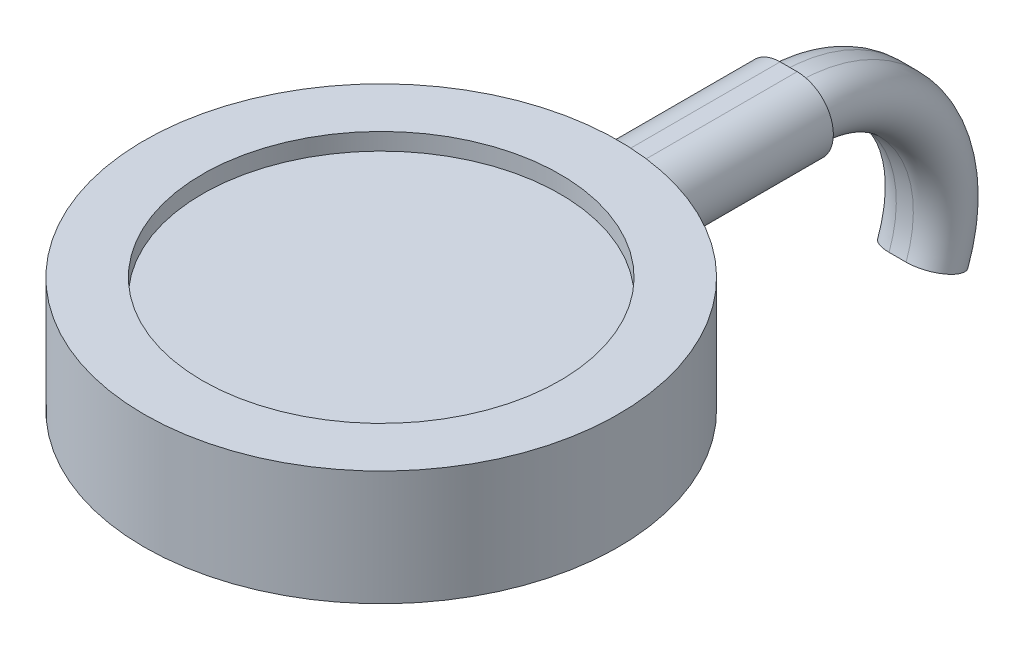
from build123d import *

# Parameters (mm, degrees)
SKETCH1_R           = 13.925
BOSS_EXTRUDE1_DEPTH = 3.375
SKETCH2_R           = 10.5
CUT_EXTRUDE1_DEPTH  = 1
BOSS_EXTRUDE2_DEPTH = 23.925


with BuildPart() as part:
    # Sketch1 → Boss-Extrude1 (new, symmetric)
    with BuildSketch(Plane(origin=(0, 0, 0), x_dir=(1, 0, 0), z_dir=(0, 1, 0))):
        with Locations(Location((0, 0, 0), (0, 0, 270))):
            Circle(SKETCH1_R)
    extrude(amount=BOSS_EXTRUDE1_DEPTH, both=True)

    # Sketch2 → Cut-Extrude1 (cut)
    with BuildSketch(Plane(origin=(0, 3.375, 0), x_dir=(1, 0, 0), z_dir=(0, 1, 0))):
        with Locations(Location((0, 0, 0), (0, 0, 270))):
            Circle(SKETCH2_R)
    extrude(amount=-CUT_EXTRUDE1_DEPTH, mode=Mode.SUBTRACT)

    # Sketch3 → Boss-Extrude2 (add)
    with BuildSketch(Plane.XY):
        with BuildLine():
            Line((-0.5, 2.125), (0.5, 2.125))
            ThreePointArc((0.5, 2.125), (2.625, 0), (0.5, -2.125))
            Line((0.5, -2.125), (-0.5, -2.125))
            ThreePointArc((-0.5, -2.125), (-2.625, 0), (-0.5, 2.125))
        make_face()
    extrude(amount=-BOSS_EXTRUDE2_DEPTH)

    # Sweep1: sweep along a path in Sketch7
    with BuildLine(Plane(origin=(0, -90.875, -61), x_dir=(0, 0, -1), z_dir=(1, 0, 0))) as sweep1_path:
        ThreePointArc((-37.075, 90.875), (-30.184980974, 87.276910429), (-29.200420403, 79.566576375))
    # Sketch8 → Sweep1 (sweep)
    with BuildSketch(Plane(origin=(0, 0, -23.925), x_dir=(-1, 0, 0), z_dir=(0, 0, -1))):
        with BuildLine():
            Line((-0.5, 1.575), (0.5, 1.575))
            ThreePointArc((0.5, 1.575), (2.075, 0), (0.5, -1.575))
            Line((0.5, -1.575), (-0.5, -1.575))
            ThreePointArc((-0.5, -1.575), (-2.075, 0), (-0.5, 1.575))
        make_face()
    sweep(path=sweep1_path.line)


solid = part.part
